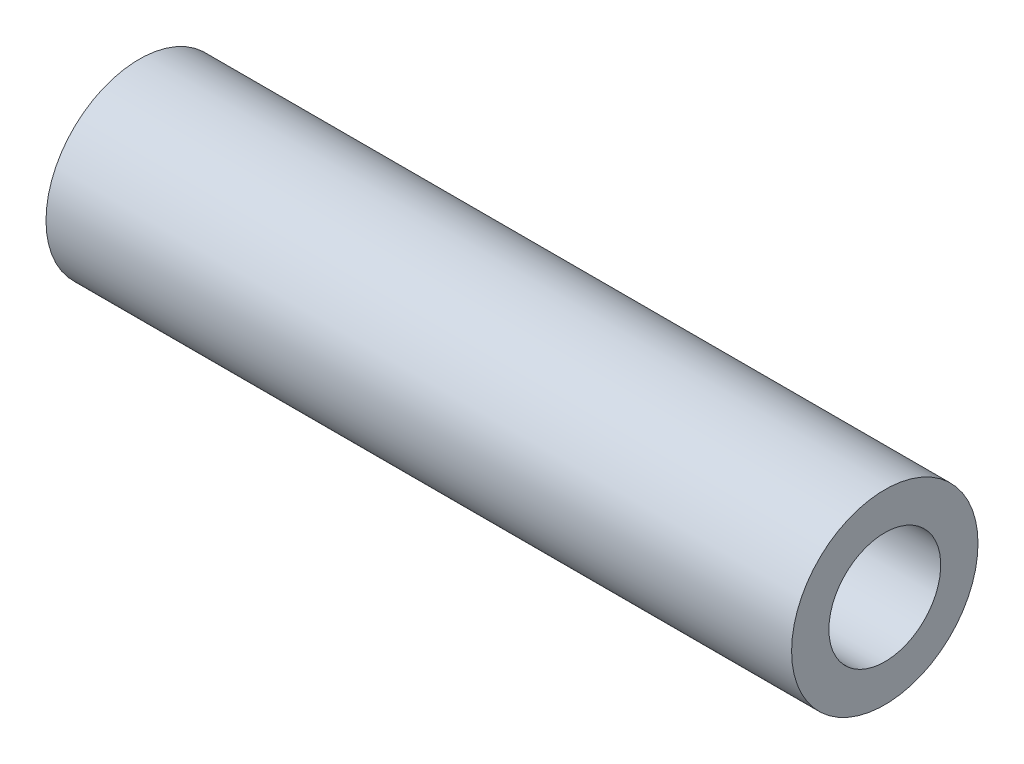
from build123d import *

# Parameters (mm, degrees)
SKETCH1_W = 100
SKETCH1_H = 5


with BuildPart() as part:
    # Sketch1 → Revolve1 (revolve)
    with BuildSketch(Plane.XY, mode=Mode.PRIVATE) as revolve1_sk:
        with Locations((50, 2.5)):
            Rectangle(SKETCH1_W, SKETCH1_H)
    revolve(revolve1_sk.sketch.rotate(Axis((0, -7.5, 0), (1, 0, 0)), 90), axis=Axis((0, -7.5, 0), (1, 0, 0)))


solid = part.part
